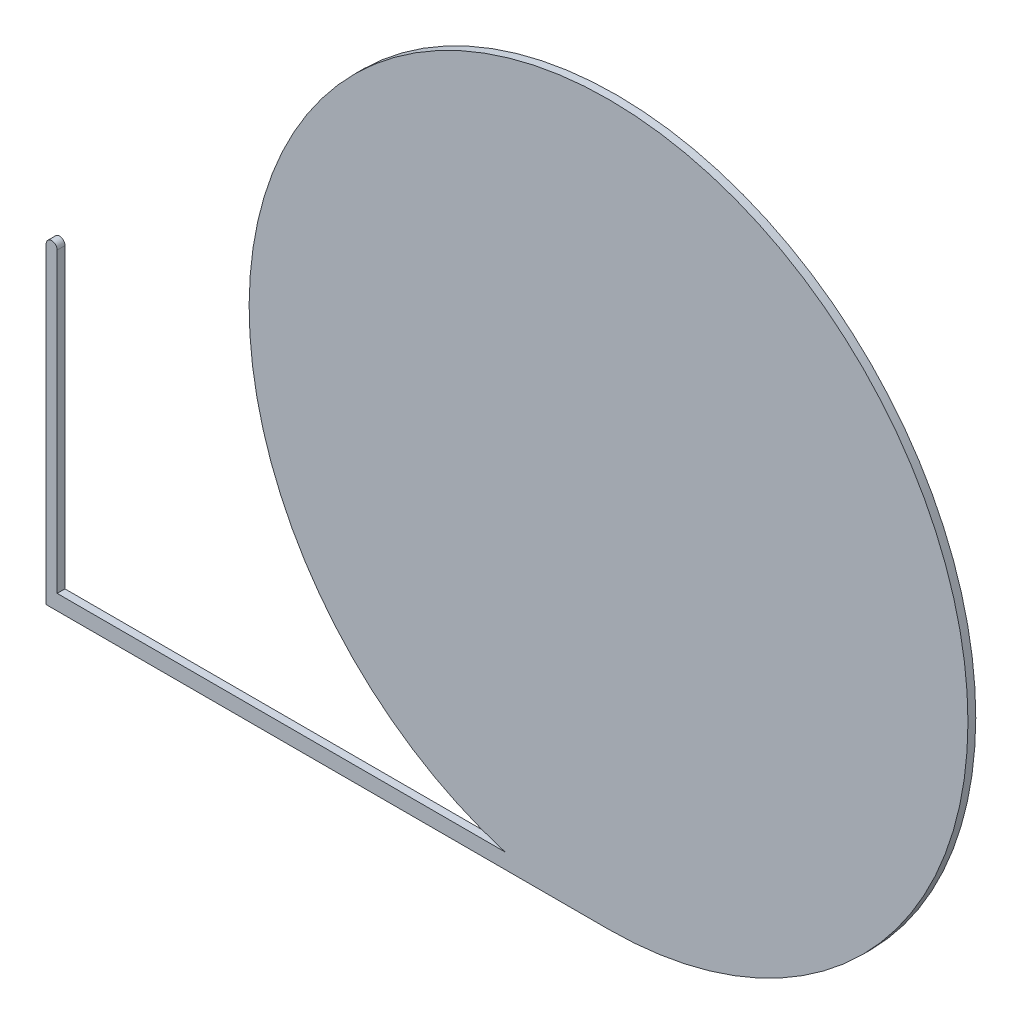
ISO-10303-21;
HEADER;
FILE_DESCRIPTION(('STEP AP214'),'2;1');
FILE_NAME('part.step','',(''),(''),'','','');
FILE_SCHEMA(('AUTOMOTIVE_DESIGN { 1 0 10303 214 1 1 1 1 }'));
ENDSEC;
DATA;
#1=APPLICATION_CONTEXT('core data for automotive mechanical design processes');
#2=APPLICATION_PROTOCOL_DEFINITION('international standard','automotive_design',2000,#1);
#3=PRODUCT_CONTEXT('',#1,'mechanical');
#4=PRODUCT('Part','Part','',(#3));
#5=PRODUCT_RELATED_PRODUCT_CATEGORY('part','',(#4));
#6=PRODUCT_DEFINITION_FORMATION('','',#4);
#7=PRODUCT_DEFINITION_CONTEXT('part definition',#1,'design');
#8=PRODUCT_DEFINITION('design','',#6,#7);
#9=PRODUCT_DEFINITION_SHAPE('','',#8);
#10=(LENGTH_UNIT() NAMED_UNIT(*) SI_UNIT(.MILLI.,.METRE.));
#11=(NAMED_UNIT(*) PLANE_ANGLE_UNIT() SI_UNIT($,.RADIAN.));
#12=(NAMED_UNIT(*) SI_UNIT($,.STERADIAN.) SOLID_ANGLE_UNIT());
#13=UNCERTAINTY_MEASURE_WITH_UNIT(LENGTH_MEASURE(1.E-05),#10,'distance_accuracy_value','');
#14=(GEOMETRIC_REPRESENTATION_CONTEXT(3) GLOBAL_UNCERTAINTY_ASSIGNED_CONTEXT((#13)) GLOBAL_UNIT_ASSIGNED_CONTEXT((#10,
#11,#12)) REPRESENTATION_CONTEXT('',''));
#15=CARTESIAN_POINT('',(0.,0.,0.));
#16=DIRECTION('',(0.,0.,1.));
#17=DIRECTION('',(1.,0.,0.));
#18=AXIS2_PLACEMENT_3D('',#15,#16,#17);
#19=CARTESIAN_POINT('',(0.,0.,10.));
#20=DIRECTION('',(0.,0.,-1.));
#21=DIRECTION('',(-1.,0.,0.));
#22=AXIS2_PLACEMENT_3D('',#19,#20,#21);
#23=CYLINDRICAL_SURFACE('',#22,460.);
#24=CARTESIAN_POINT('',(0.,0.,0.));
#25=DIRECTION('',(0.,0.,1.));
#26=DIRECTION('',(1.,0.,0.));
#27=AXIS2_PLACEMENT_3D('',#24,#25,#26);
#28=CIRCLE('',#27,460.);
#29=CARTESIAN_POINT('',(0.,-460.,0.));
#30=VERTEX_POINT('',#29);
#31=CARTESIAN_POINT('',(-132.469294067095,-440.513207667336,0.));
#32=VERTEX_POINT('',#31);
#33=EDGE_CURVE('E93',#30,#32,#28,.T.);
#34=ORIENTED_EDGE('',*,*,#33,.T.);
#35=DIRECTION('',(0.,0.,-1.));
#36=VECTOR('',#35,1.);
#37=CARTESIAN_POINT('',(-132.469294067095,-440.513207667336,10.));
#38=LINE('',#37,#36);
#39=CARTESIAN_POINT('',(-132.469294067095,-440.513207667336,10.));
#40=VERTEX_POINT('',#39);
#41=EDGE_CURVE('E11',#40,#32,#38,.T.);
#42=ORIENTED_EDGE('',*,*,#41,.F.);
#43=CARTESIAN_POINT('',(0.,0.,10.));
#44=DIRECTION('',(0.,0.,1.));
#45=DIRECTION('',(1.,0.,0.));
#46=AXIS2_PLACEMENT_3D('',#43,#44,#45);
#47=CIRCLE('',#46,460.);
#48=CARTESIAN_POINT('',(0.,-460.,10.));
#49=VERTEX_POINT('',#48);
#50=EDGE_CURVE('E116',#49,#40,#47,.T.);
#51=ORIENTED_EDGE('',*,*,#50,.F.);
#52=DIRECTION('',(0.,0.,-1.));
#53=VECTOR('',#52,1.);
#54=CARTESIAN_POINT('',(0.,-460.,10.));
#55=LINE('',#54,#53);
#56=EDGE_CURVE('E106',#49,#30,#55,.T.);
#57=ORIENTED_EDGE('',*,*,#56,.T.);
#58=EDGE_LOOP('',(#34,#42,#51,#57));
#59=FACE_BOUND('',#58,.T.);
#60=ADVANCED_FACE('F36',(#59),#23,.T.);
#61=CARTESIAN_POINT('',(-132.469294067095,-440.513207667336,10.));
#62=DIRECTION('',(0.,-1.,0.));
#63=DIRECTION('',(0.,0.,-1.));
#64=AXIS2_PLACEMENT_3D('',#61,#62,#63);
#65=PLANE('',#64);
#66=DIRECTION('',(-1.,0.,0.));
#67=VECTOR('',#66,1.);
#68=CARTESIAN_POINT('',(-132.469294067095,-440.513207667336,0.));
#69=LINE('',#68,#67);
#70=CARTESIAN_POINT('',(-705.68,-440.513207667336,0.));
#71=VERTEX_POINT('',#70);
#72=EDGE_CURVE('E89',#32,#71,#69,.T.);
#73=ORIENTED_EDGE('',*,*,#72,.T.);
#74=DIRECTION('',(0.,0.,-1.));
#75=VECTOR('',#74,1.);
#76=CARTESIAN_POINT('',(-705.68,-440.513207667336,10.));
#77=LINE('',#76,#75);
#78=CARTESIAN_POINT('',(-705.68,-440.513207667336,10.));
#79=VERTEX_POINT('',#78);
#80=EDGE_CURVE('E43',#79,#71,#77,.T.);
#81=ORIENTED_EDGE('',*,*,#80,.F.);
#82=DIRECTION('',(-1.,0.,0.));
#83=VECTOR('',#82,1.);
#84=CARTESIAN_POINT('',(-132.469294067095,-440.513207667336,10.));
#85=LINE('',#84,#83);
#86=EDGE_CURVE('E102',#40,#79,#85,.T.);
#87=ORIENTED_EDGE('',*,*,#86,.F.);
#88=ORIENTED_EDGE('',*,*,#41,.T.);
#89=EDGE_LOOP('',(#73,#81,#87,#88));
#90=FACE_BOUND('',#89,.T.);
#91=ADVANCED_FACE('F101',(#90),#65,.F.);
#92=CARTESIAN_POINT('',(-705.68,-60.,10.));
#93=DIRECTION('',(-1.,0.,0.));
#94=DIRECTION('',(0.,-1.,0.));
#95=AXIS2_PLACEMENT_3D('',#92,#93,#94);
#96=PLANE('',#95);
#97=DIRECTION('',(0.,1.,0.));
#98=VECTOR('',#97,1.);
#99=CARTESIAN_POINT('',(-705.68,-60.,0.));
#100=LINE('',#99,#98);
#101=CARTESIAN_POINT('',(-705.68,-60.,0.));
#102=VERTEX_POINT('',#101);
#103=EDGE_CURVE('E95',#71,#102,#100,.T.);
#104=ORIENTED_EDGE('',*,*,#103,.T.);
#105=DIRECTION('',(0.,0.,-1.));
#106=VECTOR('',#105,1.);
#107=CARTESIAN_POINT('',(-705.68,-60.,10.));
#108=LINE('',#107,#106);
#109=CARTESIAN_POINT('',(-705.68,-60.,10.));
#110=VERTEX_POINT('',#109);
#111=EDGE_CURVE('E134',#110,#102,#108,.T.);
#112=ORIENTED_EDGE('',*,*,#111,.F.);
#113=DIRECTION('',(0.,1.,0.));
#114=VECTOR('',#113,1.);
#115=CARTESIAN_POINT('',(-705.68,-60.,10.));
#116=LINE('',#115,#114);
#117=EDGE_CURVE('E121',#79,#110,#116,.T.);
#118=ORIENTED_EDGE('',*,*,#117,.F.);
#119=ORIENTED_EDGE('',*,*,#80,.T.);
#120=EDGE_LOOP('',(#104,#112,#118,#119));
#121=FACE_BOUND('',#120,.T.);
#122=ADVANCED_FACE('F138',(#121),#96,.F.);
#123=CARTESIAN_POINT('',(-712.68,-60.,10.));
#124=DIRECTION('',(0.,0.,-1.));
#125=DIRECTION('',(-1.,0.,0.));
#126=AXIS2_PLACEMENT_3D('',#123,#124,#125);
#127=CYLINDRICAL_SURFACE('',#126,7.00000000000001);
#128=CARTESIAN_POINT('',(-712.68,-60.,0.));
#129=DIRECTION('',(0.,0.,1.));
#130=DIRECTION('',(1.,0.,0.));
#131=AXIS2_PLACEMENT_3D('',#128,#129,#130);
#132=CIRCLE('',#131,7.00000000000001);
#133=CARTESIAN_POINT('',(-719.68,-60.,0.));
#134=VERTEX_POINT('',#133);
#135=EDGE_CURVE('E110',#102,#134,#132,.T.);
#136=ORIENTED_EDGE('',*,*,#135,.T.);
#137=DIRECTION('',(0.,0.,-1.));
#138=VECTOR('',#137,1.);
#139=CARTESIAN_POINT('',(-719.68,-60.,10.));
#140=LINE('',#139,#138);
#141=CARTESIAN_POINT('',(-719.68,-60.,10.));
#142=VERTEX_POINT('',#141);
#143=EDGE_CURVE('E131',#142,#134,#140,.T.);
#144=ORIENTED_EDGE('',*,*,#143,.F.);
#145=CARTESIAN_POINT('',(-712.68,-60.,10.));
#146=DIRECTION('',(0.,0.,1.));
#147=DIRECTION('',(1.,0.,0.));
#148=AXIS2_PLACEMENT_3D('',#145,#146,#147);
#149=CIRCLE('',#148,7.00000000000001);
#150=EDGE_CURVE('E123',#110,#142,#149,.T.);
#151=ORIENTED_EDGE('',*,*,#150,.F.);
#152=ORIENTED_EDGE('',*,*,#111,.T.);
#153=EDGE_LOOP('',(#136,#144,#151,#152));
#154=FACE_BOUND('',#153,.T.);
#155=ADVANCED_FACE('F144',(#154),#127,.T.);
#156=CARTESIAN_POINT('',(-719.68,-60.,10.));
#157=DIRECTION('',(1.,0.,0.));
#158=DIRECTION('',(0.,1.,0.));
#159=AXIS2_PLACEMENT_3D('',#156,#157,#158);
#160=PLANE('',#159);
#161=DIRECTION('',(0.,-1.,0.));
#162=VECTOR('',#161,1.);
#163=CARTESIAN_POINT('',(-719.68,-60.,0.));
#164=LINE('',#163,#162);
#165=CARTESIAN_POINT('',(-719.68,-460.,0.));
#166=VERTEX_POINT('',#165);
#167=EDGE_CURVE('E112',#134,#166,#164,.T.);
#168=ORIENTED_EDGE('',*,*,#167,.T.);
#169=DIRECTION('',(0.,0.,-1.));
#170=VECTOR('',#169,1.);
#171=CARTESIAN_POINT('',(-719.68,-460.,10.));
#172=LINE('',#171,#170);
#173=CARTESIAN_POINT('',(-719.68,-460.,10.));
#174=VERTEX_POINT('',#173);
#175=EDGE_CURVE('E128',#174,#166,#172,.T.);
#176=ORIENTED_EDGE('',*,*,#175,.F.);
#177=DIRECTION('',(0.,-1.,0.));
#178=VECTOR('',#177,1.);
#179=CARTESIAN_POINT('',(-719.68,-60.,10.));
#180=LINE('',#179,#178);
#181=EDGE_CURVE('E55',#142,#174,#180,.T.);
#182=ORIENTED_EDGE('',*,*,#181,.F.);
#183=ORIENTED_EDGE('',*,*,#143,.T.);
#184=EDGE_LOOP('',(#168,#176,#182,#183));
#185=FACE_BOUND('',#184,.T.);
#186=ADVANCED_FACE('F147',(#185),#160,.F.);
#187=CARTESIAN_POINT('',(0.,-460.,10.));
#188=DIRECTION('',(0.,1.,0.));
#189=DIRECTION('',(0.,0.,1.));
#190=AXIS2_PLACEMENT_3D('',#187,#188,#189);
#191=PLANE('',#190);
#192=DIRECTION('',(1.,0.,0.));
#193=VECTOR('',#192,1.);
#194=CARTESIAN_POINT('',(0.,-460.,0.));
#195=LINE('',#194,#193);
#196=EDGE_CURVE('E114',#166,#30,#195,.T.);
#197=ORIENTED_EDGE('',*,*,#196,.T.);
#198=ORIENTED_EDGE('',*,*,#56,.F.);
#199=DIRECTION('',(1.,0.,0.));
#200=VECTOR('',#199,1.);
#201=CARTESIAN_POINT('',(0.,-460.,10.));
#202=LINE('',#201,#200);
#203=EDGE_CURVE('E50',#174,#49,#202,.T.);
#204=ORIENTED_EDGE('',*,*,#203,.F.);
#205=ORIENTED_EDGE('',*,*,#175,.T.);
#206=EDGE_LOOP('',(#197,#198,#204,#205));
#207=FACE_BOUND('',#206,.T.);
#208=ADVANCED_FACE('F149',(#207),#191,.F.);
#209=CARTESIAN_POINT('',(0.,0.,10.));
#210=DIRECTION('',(0.,0.,1.));
#211=DIRECTION('',(1.,0.,0.));
#212=AXIS2_PLACEMENT_3D('',#209,#210,#211);
#213=PLANE('',#212);
#214=ORIENTED_EDGE('',*,*,#50,.T.);
#215=ORIENTED_EDGE('',*,*,#86,.T.);
#216=ORIENTED_EDGE('',*,*,#117,.T.);
#217=ORIENTED_EDGE('',*,*,#150,.T.);
#218=ORIENTED_EDGE('',*,*,#181,.T.);
#219=ORIENTED_EDGE('',*,*,#203,.T.);
#220=EDGE_LOOP('',(#214,#215,#216,#217,#218,#219));
#221=FACE_BOUND('',#220,.T.);
#222=ADVANCED_FACE('F141',(#221),#213,.T.);
#223=CARTESIAN_POINT('',(0.,0.,0.));
#224=DIRECTION('',(0.,0.,1.));
#225=DIRECTION('',(1.,0.,0.));
#226=AXIS2_PLACEMENT_3D('',#223,#224,#225);
#227=PLANE('',#226);
#228=ORIENTED_EDGE('',*,*,#33,.F.);
#229=ORIENTED_EDGE('',*,*,#196,.F.);
#230=ORIENTED_EDGE('',*,*,#167,.F.);
#231=ORIENTED_EDGE('',*,*,#135,.F.);
#232=ORIENTED_EDGE('',*,*,#103,.F.);
#233=ORIENTED_EDGE('',*,*,#72,.F.);
#234=EDGE_LOOP('',(#228,#229,#230,#231,#232,#233));
#235=FACE_BOUND('',#234,.T.);
#236=ADVANCED_FACE('F90',(#235),#227,.F.);
#237=CLOSED_SHELL('',(#60,#91,#122,#155,#186,#208,#222,#236));
#238=MANIFOLD_SOLID_BREP('B2',#237);
#239=ADVANCED_BREP_SHAPE_REPRESENTATION('',(#18,#238),#14);
#240=SHAPE_DEFINITION_REPRESENTATION(#9,#239);
ENDSEC;
END-ISO-10303-21;
